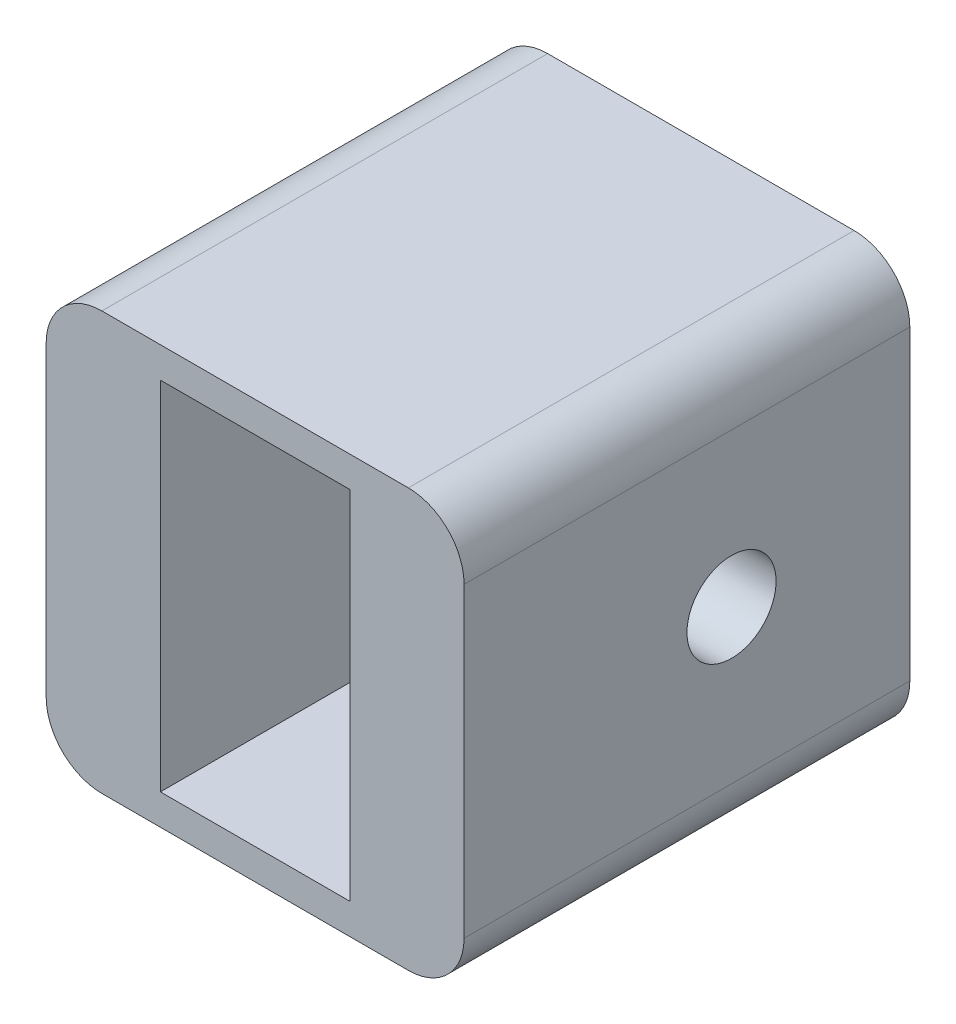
ISO-10303-21;
HEADER;
FILE_DESCRIPTION(('STEP AP214'),'2;1');
FILE_NAME('part.step','',(''),(''),'','','');
FILE_SCHEMA(('AUTOMOTIVE_DESIGN { 1 0 10303 214 1 1 1 1 }'));
ENDSEC;
DATA;
#1=APPLICATION_CONTEXT('core data for automotive mechanical design processes');
#2=APPLICATION_PROTOCOL_DEFINITION('international standard','automotive_design',2000,#1);
#3=PRODUCT_CONTEXT('',#1,'mechanical');
#4=PRODUCT('Part','Part','',(#3));
#5=PRODUCT_RELATED_PRODUCT_CATEGORY('part','',(#4));
#6=PRODUCT_DEFINITION_FORMATION('','',#4);
#7=PRODUCT_DEFINITION_CONTEXT('part definition',#1,'design');
#8=PRODUCT_DEFINITION('design','',#6,#7);
#9=PRODUCT_DEFINITION_SHAPE('','',#8);
#10=(LENGTH_UNIT() NAMED_UNIT(*) SI_UNIT(.MILLI.,.METRE.));
#11=(NAMED_UNIT(*) PLANE_ANGLE_UNIT() SI_UNIT($,.RADIAN.));
#12=(NAMED_UNIT(*) SI_UNIT($,.STERADIAN.) SOLID_ANGLE_UNIT());
#13=UNCERTAINTY_MEASURE_WITH_UNIT(LENGTH_MEASURE(1.E-05),#10,'distance_accuracy_value','');
#14=(GEOMETRIC_REPRESENTATION_CONTEXT(3) GLOBAL_UNCERTAINTY_ASSIGNED_CONTEXT((#13)) GLOBAL_UNIT_ASSIGNED_CONTEXT((#10,
#11,#12)) REPRESENTATION_CONTEXT('',''));
#15=CARTESIAN_POINT('',(0.,0.,0.));
#16=DIRECTION('',(0.,0.,1.));
#17=DIRECTION('',(1.,0.,0.));
#18=AXIS2_PLACEMENT_3D('',#15,#16,#17);
#19=CARTESIAN_POINT('',(-37.5,0.,32.));
#20=DIRECTION('',(1.,0.,0.));
#21=DIRECTION('',(0.,1.,0.));
#22=AXIS2_PLACEMENT_3D('',#19,#20,#21);
#23=CYLINDRICAL_SURFACE('',#22,8.);
#24=CARTESIAN_POINT('',(-17.,0.,32.));
#25=DIRECTION('',(-1.,0.,0.));
#26=DIRECTION('',(0.,-1.,0.));
#27=AXIS2_PLACEMENT_3D('',#24,#25,#26);
#28=CIRCLE('',#27,8.);
#29=CARTESIAN_POINT('',(-17.,-8.,32.));
#30=VERTEX_POINT('',#29);
#31=EDGE_CURVE('E28',#30,#30,#28,.F.);
#32=ORIENTED_EDGE('',*,*,#31,.T.);
#33=EDGE_LOOP('',(#32));
#34=FACE_BOUND('',#33,.T.);
#35=CARTESIAN_POINT('',(-37.5,0.,32.));
#36=DIRECTION('',(1.,0.,0.));
#37=DIRECTION('',(0.,1.,0.));
#38=AXIS2_PLACEMENT_3D('',#35,#36,#37);
#39=CIRCLE('',#38,8.);
#40=CARTESIAN_POINT('',(-37.5,8.00000000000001,32.));
#41=VERTEX_POINT('',#40);
#42=EDGE_CURVE('E156',#41,#41,#39,.T.);
#43=ORIENTED_EDGE('',*,*,#42,.F.);
#44=EDGE_LOOP('',(#43));
#45=FACE_BOUND('',#44,.T.);
#46=ADVANCED_FACE('F24',(#34,#45),#23,.F.);
#47=CARTESIAN_POINT('',(-27.5,27.5,80.));
#48=DIRECTION('',(0.,0.,-1.));
#49=DIRECTION('',(-1.,0.,0.));
#50=AXIS2_PLACEMENT_3D('',#47,#48,#49);
#51=CYLINDRICAL_SURFACE('',#50,10.);
#52=CARTESIAN_POINT('',(-27.5,27.5,0.));
#53=DIRECTION('',(0.,0.,1.));
#54=DIRECTION('',(-1.,0.,0.));
#55=AXIS2_PLACEMENT_3D('',#52,#53,#54);
#56=CIRCLE('',#55,10.);
#57=CARTESIAN_POINT('',(-27.4999999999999,37.5,0.));
#58=VERTEX_POINT('',#57);
#59=CARTESIAN_POINT('',(-37.5,27.4999999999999,0.));
#60=VERTEX_POINT('',#59);
#61=EDGE_CURVE('E159',#58,#60,#56,.T.);
#62=ORIENTED_EDGE('',*,*,#61,.T.);
#63=DIRECTION('',(0.,0.,-1.));
#64=VECTOR('',#63,1.);
#65=CARTESIAN_POINT('',(-37.5,27.4999999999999,80.));
#66=LINE('',#65,#64);
#67=CARTESIAN_POINT('',(-37.5,27.4999999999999,80.));
#68=VERTEX_POINT('',#67);
#69=EDGE_CURVE('E11',#68,#60,#66,.T.);
#70=ORIENTED_EDGE('',*,*,#69,.F.);
#71=CARTESIAN_POINT('',(-27.5,27.5,80.));
#72=DIRECTION('',(0.,0.,1.));
#73=DIRECTION('',(-1.,0.,0.));
#74=AXIS2_PLACEMENT_3D('',#71,#72,#73);
#75=CIRCLE('',#74,10.);
#76=CARTESIAN_POINT('',(-27.4999999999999,37.5,80.));
#77=VERTEX_POINT('',#76);
#78=EDGE_CURVE('E176',#77,#68,#75,.T.);
#79=ORIENTED_EDGE('',*,*,#78,.F.);
#80=DIRECTION('',(0.,0.,-1.));
#81=VECTOR('',#80,1.);
#82=CARTESIAN_POINT('',(-27.4999999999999,37.5,80.));
#83=LINE('',#82,#81);
#84=EDGE_CURVE('E193',#77,#58,#83,.T.);
#85=ORIENTED_EDGE('',*,*,#84,.T.);
#86=EDGE_LOOP('',(#62,#70,#79,#85));
#87=FACE_BOUND('',#86,.T.);
#88=ADVANCED_FACE('F26',(#87),#51,.T.);
#89=CARTESIAN_POINT('',(-37.5,27.4999999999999,80.));
#90=DIRECTION('',(1.,0.,0.));
#91=DIRECTION('',(0.,0.,-1.));
#92=AXIS2_PLACEMENT_3D('',#89,#90,#91);
#93=PLANE('',#92);
#94=ORIENTED_EDGE('',*,*,#42,.T.);
#95=EDGE_LOOP('',(#94));
#96=FACE_BOUND('',#95,.T.);
#97=DIRECTION('',(0.,-1.,0.));
#98=VECTOR('',#97,1.);
#99=CARTESIAN_POINT('',(-37.5,27.4999999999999,0.));
#100=LINE('',#99,#98);
#101=CARTESIAN_POINT('',(-37.5,-27.4999999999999,0.));
#102=VERTEX_POINT('',#101);
#103=EDGE_CURVE('E162',#60,#102,#100,.T.);
#104=ORIENTED_EDGE('',*,*,#103,.T.);
#105=DIRECTION('',(0.,0.,-1.));
#106=VECTOR('',#105,1.);
#107=CARTESIAN_POINT('',(-37.5,-27.4999999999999,80.));
#108=LINE('',#107,#106);
#109=CARTESIAN_POINT('',(-37.5,-27.4999999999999,80.));
#110=VERTEX_POINT('',#109);
#111=EDGE_CURVE('E33',#110,#102,#108,.T.);
#112=ORIENTED_EDGE('',*,*,#111,.F.);
#113=DIRECTION('',(0.,-1.,0.));
#114=VECTOR('',#113,1.);
#115=CARTESIAN_POINT('',(-37.5,27.4999999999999,80.));
#116=LINE('',#115,#114);
#117=EDGE_CURVE('E179',#68,#110,#116,.T.);
#118=ORIENTED_EDGE('',*,*,#117,.F.);
#119=ORIENTED_EDGE('',*,*,#69,.T.);
#120=EDGE_LOOP('',(#104,#112,#118,#119));
#121=FACE_BOUND('',#120,.T.);
#122=ADVANCED_FACE('F237',(#96,#121),#93,.F.);
#123=CARTESIAN_POINT('',(-27.5,-27.5,80.));
#124=DIRECTION('',(0.,0.,-1.));
#125=DIRECTION('',(-1.,0.,0.));
#126=AXIS2_PLACEMENT_3D('',#123,#124,#125);
#127=CYLINDRICAL_SURFACE('',#126,10.);
#128=CARTESIAN_POINT('',(-27.5,-27.5,0.));
#129=DIRECTION('',(0.,0.,1.));
#130=DIRECTION('',(-1.,0.,0.));
#131=AXIS2_PLACEMENT_3D('',#128,#129,#130);
#132=CIRCLE('',#131,10.);
#133=CARTESIAN_POINT('',(-27.4999999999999,-37.5,0.));
#134=VERTEX_POINT('',#133);
#135=EDGE_CURVE('E164',#102,#134,#132,.T.);
#136=ORIENTED_EDGE('',*,*,#135,.T.);
#137=DIRECTION('',(0.,0.,-1.));
#138=VECTOR('',#137,1.);
#139=CARTESIAN_POINT('',(-27.4999999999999,-37.5,80.));
#140=LINE('',#139,#138);
#141=CARTESIAN_POINT('',(-27.4999999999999,-37.5,80.));
#142=VERTEX_POINT('',#141);
#143=EDGE_CURVE('E208',#142,#134,#140,.T.);
#144=ORIENTED_EDGE('',*,*,#143,.F.);
#145=CARTESIAN_POINT('',(-27.5,-27.5,80.));
#146=DIRECTION('',(0.,0.,1.));
#147=DIRECTION('',(-1.,0.,0.));
#148=AXIS2_PLACEMENT_3D('',#145,#146,#147);
#149=CIRCLE('',#148,10.);
#150=EDGE_CURVE('E181',#110,#142,#149,.T.);
#151=ORIENTED_EDGE('',*,*,#150,.F.);
#152=ORIENTED_EDGE('',*,*,#111,.T.);
#153=EDGE_LOOP('',(#136,#144,#151,#152));
#154=FACE_BOUND('',#153,.T.);
#155=ADVANCED_FACE('F264',(#154),#127,.T.);
#156=CARTESIAN_POINT('',(-27.4999999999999,-37.5,80.));
#157=DIRECTION('',(0.,1.,0.));
#158=DIRECTION('',(0.,0.,1.));
#159=AXIS2_PLACEMENT_3D('',#156,#157,#158);
#160=PLANE('',#159);
#161=DIRECTION('',(1.,0.,0.));
#162=VECTOR('',#161,1.);
#163=CARTESIAN_POINT('',(-27.4999999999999,-37.5,0.));
#164=LINE('',#163,#162);
#165=CARTESIAN_POINT('',(27.4999999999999,-37.5,0.));
#166=VERTEX_POINT('',#165);
#167=EDGE_CURVE('E166',#134,#166,#164,.T.);
#168=ORIENTED_EDGE('',*,*,#167,.T.);
#169=DIRECTION('',(0.,0.,-1.));
#170=VECTOR('',#169,1.);
#171=CARTESIAN_POINT('',(27.4999999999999,-37.5,80.));
#172=LINE('',#171,#170);
#173=CARTESIAN_POINT('',(27.4999999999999,-37.5,80.));
#174=VERTEX_POINT('',#173);
#175=EDGE_CURVE('E205',#174,#166,#172,.T.);
#176=ORIENTED_EDGE('',*,*,#175,.F.);
#177=DIRECTION('',(1.,0.,0.));
#178=VECTOR('',#177,1.);
#179=CARTESIAN_POINT('',(-27.4999999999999,-37.5,80.));
#180=LINE('',#179,#178);
#181=EDGE_CURVE('E183',#142,#174,#180,.T.);
#182=ORIENTED_EDGE('',*,*,#181,.F.);
#183=ORIENTED_EDGE('',*,*,#143,.T.);
#184=EDGE_LOOP('',(#168,#176,#182,#183));
#185=FACE_BOUND('',#184,.T.);
#186=ADVANCED_FACE('F260',(#185),#160,.F.);
#187=CARTESIAN_POINT('',(27.5,-27.5,80.));
#188=DIRECTION('',(0.,0.,-1.));
#189=DIRECTION('',(-1.,0.,0.));
#190=AXIS2_PLACEMENT_3D('',#187,#188,#189);
#191=CYLINDRICAL_SURFACE('',#190,10.);
#192=CARTESIAN_POINT('',(27.5,-27.5,0.));
#193=DIRECTION('',(0.,0.,1.));
#194=DIRECTION('',(-1.,0.,0.));
#195=AXIS2_PLACEMENT_3D('',#192,#193,#194);
#196=CIRCLE('',#195,10.);
#197=CARTESIAN_POINT('',(37.5,-27.4999999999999,0.));
#198=VERTEX_POINT('',#197);
#199=EDGE_CURVE('E168',#166,#198,#196,.T.);
#200=ORIENTED_EDGE('',*,*,#199,.T.);
#201=DIRECTION('',(0.,0.,-1.));
#202=VECTOR('',#201,1.);
#203=CARTESIAN_POINT('',(37.5,-27.4999999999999,80.));
#204=LINE('',#203,#202);
#205=CARTESIAN_POINT('',(37.5,-27.4999999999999,80.));
#206=VERTEX_POINT('',#205);
#207=EDGE_CURVE('E202',#206,#198,#204,.T.);
#208=ORIENTED_EDGE('',*,*,#207,.F.);
#209=CARTESIAN_POINT('',(27.5,-27.5,80.));
#210=DIRECTION('',(0.,0.,1.));
#211=DIRECTION('',(-1.,0.,0.));
#212=AXIS2_PLACEMENT_3D('',#209,#210,#211);
#213=CIRCLE('',#212,10.);
#214=EDGE_CURVE('E185',#174,#206,#213,.T.);
#215=ORIENTED_EDGE('',*,*,#214,.F.);
#216=ORIENTED_EDGE('',*,*,#175,.T.);
#217=EDGE_LOOP('',(#200,#208,#215,#216));
#218=FACE_BOUND('',#217,.T.);
#219=ADVANCED_FACE('F256',(#218),#191,.T.);
#220=CARTESIAN_POINT('',(37.5,27.4999999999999,80.));
#221=DIRECTION('',(-1.,0.,0.));
#222=DIRECTION('',(0.,-1.,0.));
#223=AXIS2_PLACEMENT_3D('',#220,#221,#222);
#224=PLANE('',#223);
#225=CARTESIAN_POINT('',(37.5,0.,32.));
#226=DIRECTION('',(1.,0.,0.));
#227=DIRECTION('',(0.,1.,0.));
#228=AXIS2_PLACEMENT_3D('',#225,#226,#227);
#229=CIRCLE('',#228,8.);
#230=CARTESIAN_POINT('',(37.5,7.99999999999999,32.));
#231=VERTEX_POINT('',#230);
#232=EDGE_CURVE('E153',#231,#231,#229,.T.);
#233=ORIENTED_EDGE('',*,*,#232,.F.);
#234=EDGE_LOOP('',(#233));
#235=FACE_BOUND('',#234,.T.);
#236=DIRECTION('',(0.,1.,0.));
#237=VECTOR('',#236,1.);
#238=CARTESIAN_POINT('',(37.5,27.4999999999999,0.));
#239=LINE('',#238,#237);
#240=CARTESIAN_POINT('',(37.5,27.4999999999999,0.));
#241=VERTEX_POINT('',#240);
#242=EDGE_CURVE('E170',#198,#241,#239,.T.);
#243=ORIENTED_EDGE('',*,*,#242,.T.);
#244=DIRECTION('',(0.,0.,-1.));
#245=VECTOR('',#244,1.);
#246=CARTESIAN_POINT('',(37.5,27.4999999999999,80.));
#247=LINE('',#246,#245);
#248=CARTESIAN_POINT('',(37.5,27.4999999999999,80.));
#249=VERTEX_POINT('',#248);
#250=EDGE_CURVE('E199',#249,#241,#247,.T.);
#251=ORIENTED_EDGE('',*,*,#250,.F.);
#252=DIRECTION('',(0.,1.,0.));
#253=VECTOR('',#252,1.);
#254=CARTESIAN_POINT('',(37.5,27.4999999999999,80.));
#255=LINE('',#254,#253);
#256=EDGE_CURVE('E187',#206,#249,#255,.T.);
#257=ORIENTED_EDGE('',*,*,#256,.F.);
#258=ORIENTED_EDGE('',*,*,#207,.T.);
#259=EDGE_LOOP('',(#243,#251,#257,#258));
#260=FACE_BOUND('',#259,.T.);
#261=ADVANCED_FACE('F252',(#235,#260),#224,.F.);
#262=CARTESIAN_POINT('',(27.5,27.5,80.));
#263=DIRECTION('',(0.,0.,-1.));
#264=DIRECTION('',(-1.,0.,0.));
#265=AXIS2_PLACEMENT_3D('',#262,#263,#264);
#266=CYLINDRICAL_SURFACE('',#265,10.);
#267=CARTESIAN_POINT('',(27.5,27.5,0.));
#268=DIRECTION('',(0.,0.,1.));
#269=DIRECTION('',(-1.,0.,0.));
#270=AXIS2_PLACEMENT_3D('',#267,#268,#269);
#271=CIRCLE('',#270,10.);
#272=CARTESIAN_POINT('',(27.4999999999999,37.5,0.));
#273=VERTEX_POINT('',#272);
#274=EDGE_CURVE('E172',#241,#273,#271,.T.);
#275=ORIENTED_EDGE('',*,*,#274,.T.);
#276=DIRECTION('',(0.,0.,-1.));
#277=VECTOR('',#276,1.);
#278=CARTESIAN_POINT('',(27.4999999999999,37.5,80.));
#279=LINE('',#278,#277);
#280=CARTESIAN_POINT('',(27.4999999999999,37.5,80.));
#281=VERTEX_POINT('',#280);
#282=EDGE_CURVE('E196',#281,#273,#279,.T.);
#283=ORIENTED_EDGE('',*,*,#282,.F.);
#284=CARTESIAN_POINT('',(27.5,27.5,80.));
#285=DIRECTION('',(0.,0.,1.));
#286=DIRECTION('',(-1.,0.,0.));
#287=AXIS2_PLACEMENT_3D('',#284,#285,#286);
#288=CIRCLE('',#287,10.);
#289=EDGE_CURVE('E189',#249,#281,#288,.T.);
#290=ORIENTED_EDGE('',*,*,#289,.F.);
#291=ORIENTED_EDGE('',*,*,#250,.T.);
#292=EDGE_LOOP('',(#275,#283,#290,#291));
#293=FACE_BOUND('',#292,.T.);
#294=ADVANCED_FACE('F248',(#293),#266,.T.);
#295=CARTESIAN_POINT('',(-27.4999999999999,37.5,80.));
#296=DIRECTION('',(0.,-1.,0.));
#297=DIRECTION('',(0.,0.,-1.));
#298=AXIS2_PLACEMENT_3D('',#295,#296,#297);
#299=PLANE('',#298);
#300=DIRECTION('',(-1.,0.,0.));
#301=VECTOR('',#300,1.);
#302=CARTESIAN_POINT('',(-27.4999999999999,37.5,0.));
#303=LINE('',#302,#301);
#304=EDGE_CURVE('E174',#273,#58,#303,.T.);
#305=ORIENTED_EDGE('',*,*,#304,.T.);
#306=ORIENTED_EDGE('',*,*,#84,.F.);
#307=DIRECTION('',(-1.,0.,0.));
#308=VECTOR('',#307,1.);
#309=CARTESIAN_POINT('',(-27.4999999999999,37.5,80.));
#310=LINE('',#309,#308);
#311=EDGE_CURVE('E191',#281,#77,#310,.T.);
#312=ORIENTED_EDGE('',*,*,#311,.F.);
#313=ORIENTED_EDGE('',*,*,#282,.T.);
#314=EDGE_LOOP('',(#305,#306,#312,#313));
#315=FACE_BOUND('',#314,.T.);
#316=ADVANCED_FACE('F245',(#315),#299,.F.);
#317=CARTESIAN_POINT('',(-27.5,27.5,80.));
#318=DIRECTION('',(0.,0.,-1.));
#319=DIRECTION('',(-1.,0.,0.));
#320=AXIS2_PLACEMENT_3D('',#317,#318,#319);
#321=PLANE('',#320);
#322=DIRECTION('',(1.,0.,0.));
#323=VECTOR('',#322,1.);
#324=CARTESIAN_POINT('',(-17.,-32.,80.));
#325=LINE('',#324,#323);
#326=CARTESIAN_POINT('',(-17.,-32.,80.));
#327=VERTEX_POINT('',#326);
#328=CARTESIAN_POINT('',(17.,-32.,80.));
#329=VERTEX_POINT('',#328);
#330=EDGE_CURVE('E127',#327,#329,#325,.T.);
#331=ORIENTED_EDGE('',*,*,#330,.F.);
#332=DIRECTION('',(0.,-1.,0.));
#333=VECTOR('',#332,1.);
#334=CARTESIAN_POINT('',(-17.,32.,80.));
#335=LINE('',#334,#333);
#336=CARTESIAN_POINT('',(-17.,32.,80.));
#337=VERTEX_POINT('',#336);
#338=EDGE_CURVE('E41',#337,#327,#335,.T.);
#339=ORIENTED_EDGE('',*,*,#338,.F.);
#340=DIRECTION('',(-1.,0.,0.));
#341=VECTOR('',#340,1.);
#342=CARTESIAN_POINT('',(-17.,32.,80.));
#343=LINE('',#342,#341);
#344=CARTESIAN_POINT('',(17.,32.,80.));
#345=VERTEX_POINT('',#344);
#346=EDGE_CURVE('E134',#345,#337,#343,.T.);
#347=ORIENTED_EDGE('',*,*,#346,.F.);
#348=DIRECTION('',(0.,1.,0.));
#349=VECTOR('',#348,1.);
#350=CARTESIAN_POINT('',(17.,32.,80.));
#351=LINE('',#350,#349);
#352=EDGE_CURVE('E118',#329,#345,#351,.T.);
#353=ORIENTED_EDGE('',*,*,#352,.F.);
#354=EDGE_LOOP('',(#331,#339,#347,#353));
#355=FACE_BOUND('',#354,.T.);
#356=ORIENTED_EDGE('',*,*,#78,.T.);
#357=ORIENTED_EDGE('',*,*,#117,.T.);
#358=ORIENTED_EDGE('',*,*,#150,.T.);
#359=ORIENTED_EDGE('',*,*,#181,.T.);
#360=ORIENTED_EDGE('',*,*,#214,.T.);
#361=ORIENTED_EDGE('',*,*,#256,.T.);
#362=ORIENTED_EDGE('',*,*,#289,.T.);
#363=ORIENTED_EDGE('',*,*,#311,.T.);
#364=EDGE_LOOP('',(#356,#357,#358,#359,#360,#361,#362,#363));
#365=FACE_BOUND('',#364,.T.);
#366=ADVANCED_FACE('F131',(#355,#365),#321,.F.);
#367=CARTESIAN_POINT('',(-27.5,27.5,0.));
#368=DIRECTION('',(0.,0.,-1.));
#369=DIRECTION('',(-1.,0.,0.));
#370=AXIS2_PLACEMENT_3D('',#367,#368,#369);
#371=PLANE('',#370);
#372=DIRECTION('',(0.,-1.,0.));
#373=VECTOR('',#372,1.);
#374=CARTESIAN_POINT('',(-17.,32.,0.));
#375=LINE('',#374,#373);
#376=CARTESIAN_POINT('',(-17.,32.,0.));
#377=VERTEX_POINT('',#376);
#378=CARTESIAN_POINT('',(-17.,-32.,0.));
#379=VERTEX_POINT('',#378);
#380=EDGE_CURVE('E136',#377,#379,#375,.T.);
#381=ORIENTED_EDGE('',*,*,#380,.T.);
#382=DIRECTION('',(1.,0.,0.));
#383=VECTOR('',#382,1.);
#384=CARTESIAN_POINT('',(-17.,-32.,0.));
#385=LINE('',#384,#383);
#386=CARTESIAN_POINT('',(17.,-32.,0.));
#387=VERTEX_POINT('',#386);
#388=EDGE_CURVE('E142',#379,#387,#385,.T.);
#389=ORIENTED_EDGE('',*,*,#388,.T.);
#390=DIRECTION('',(0.,1.,0.));
#391=VECTOR('',#390,1.);
#392=CARTESIAN_POINT('',(17.,32.,0.));
#393=LINE('',#392,#391);
#394=CARTESIAN_POINT('',(17.,32.,0.));
#395=VERTEX_POINT('',#394);
#396=EDGE_CURVE('E49',#387,#395,#393,.T.);
#397=ORIENTED_EDGE('',*,*,#396,.T.);
#398=DIRECTION('',(-1.,0.,0.));
#399=VECTOR('',#398,1.);
#400=CARTESIAN_POINT('',(-17.,32.,0.));
#401=LINE('',#400,#399);
#402=EDGE_CURVE('E145',#395,#377,#401,.T.);
#403=ORIENTED_EDGE('',*,*,#402,.T.);
#404=EDGE_LOOP('',(#381,#389,#397,#403));
#405=FACE_BOUND('',#404,.T.);
#406=ORIENTED_EDGE('',*,*,#61,.F.);
#407=ORIENTED_EDGE('',*,*,#304,.F.);
#408=ORIENTED_EDGE('',*,*,#274,.F.);
#409=ORIENTED_EDGE('',*,*,#242,.F.);
#410=ORIENTED_EDGE('',*,*,#199,.F.);
#411=ORIENTED_EDGE('',*,*,#167,.F.);
#412=ORIENTED_EDGE('',*,*,#135,.F.);
#413=ORIENTED_EDGE('',*,*,#103,.F.);
#414=EDGE_LOOP('',(#406,#407,#408,#409,#410,#411,#412,#413));
#415=FACE_BOUND('',#414,.T.);
#416=ADVANCED_FACE('F230',(#405,#415),#371,.T.);
#417=CARTESIAN_POINT('',(17.,0.,32.));
#418=DIRECTION('',(1.,0.,0.));
#419=DIRECTION('',(0.,1.,0.));
#420=AXIS2_PLACEMENT_3D('',#417,#418,#419);
#421=CIRCLE('',#420,8.);
#422=CARTESIAN_POINT('',(17.,8.,32.));
#423=VERTEX_POINT('',#422);
#424=EDGE_CURVE('E150',#423,#423,#421,.F.);
#425=ORIENTED_EDGE('',*,*,#424,.T.);
#426=EDGE_LOOP('',(#425));
#427=FACE_BOUND('',#426,.T.);
#428=ORIENTED_EDGE('',*,*,#232,.T.);
#429=EDGE_LOOP('',(#428));
#430=FACE_BOUND('',#429,.T.);
#431=ADVANCED_FACE('F222',(#427,#430),#23,.F.);
#432=CARTESIAN_POINT('',(-17.,32.,0.));
#433=DIRECTION('',(-1.,0.,0.));
#434=DIRECTION('',(0.,-1.,0.));
#435=AXIS2_PLACEMENT_3D('',#432,#433,#434);
#436=PLANE('',#435);
#437=ORIENTED_EDGE('',*,*,#338,.T.);
#438=DIRECTION('',(0.,0.,1.));
#439=VECTOR('',#438,1.);
#440=CARTESIAN_POINT('',(-17.,-32.,0.));
#441=LINE('',#440,#439);
#442=EDGE_CURVE('E124',#379,#327,#441,.T.);
#443=ORIENTED_EDGE('',*,*,#442,.F.);
#444=ORIENTED_EDGE('',*,*,#380,.F.);
#445=DIRECTION('',(0.,0.,1.));
#446=VECTOR('',#445,1.);
#447=CARTESIAN_POINT('',(-17.,32.,0.));
#448=LINE('',#447,#446);
#449=EDGE_CURVE('E148',#377,#337,#448,.T.);
#450=ORIENTED_EDGE('',*,*,#449,.T.);
#451=EDGE_LOOP('',(#437,#443,#444,#450));
#452=FACE_BOUND('',#451,.T.);
#453=ORIENTED_EDGE('',*,*,#31,.F.);
#454=EDGE_LOOP('',(#453));
#455=FACE_BOUND('',#454,.T.);
#456=ADVANCED_FACE('F220',(#452,#455),#436,.F.);
#457=CARTESIAN_POINT('',(17.,32.,0.));
#458=DIRECTION('',(1.,0.,0.));
#459=DIRECTION('',(0.,1.,0.));
#460=AXIS2_PLACEMENT_3D('',#457,#458,#459);
#461=PLANE('',#460);
#462=ORIENTED_EDGE('',*,*,#352,.T.);
#463=DIRECTION('',(0.,0.,1.));
#464=VECTOR('',#463,1.);
#465=CARTESIAN_POINT('',(17.,32.,0.));
#466=LINE('',#465,#464);
#467=EDGE_CURVE('E123',#395,#345,#466,.T.);
#468=ORIENTED_EDGE('',*,*,#467,.F.);
#469=ORIENTED_EDGE('',*,*,#396,.F.);
#470=DIRECTION('',(0.,0.,1.));
#471=VECTOR('',#470,1.);
#472=CARTESIAN_POINT('',(17.,-32.,0.));
#473=LINE('',#472,#471);
#474=EDGE_CURVE('E113',#387,#329,#473,.T.);
#475=ORIENTED_EDGE('',*,*,#474,.T.);
#476=EDGE_LOOP('',(#462,#468,#469,#475));
#477=FACE_BOUND('',#476,.T.);
#478=ORIENTED_EDGE('',*,*,#424,.F.);
#479=EDGE_LOOP('',(#478));
#480=FACE_BOUND('',#479,.T.);
#481=ADVANCED_FACE('F115',(#477,#480),#461,.F.);
#482=CARTESIAN_POINT('',(-17.,32.,0.));
#483=DIRECTION('',(0.,1.,0.));
#484=DIRECTION('',(0.,0.,1.));
#485=AXIS2_PLACEMENT_3D('',#482,#483,#484);
#486=PLANE('',#485);
#487=ORIENTED_EDGE('',*,*,#346,.T.);
#488=ORIENTED_EDGE('',*,*,#449,.F.);
#489=ORIENTED_EDGE('',*,*,#402,.F.);
#490=ORIENTED_EDGE('',*,*,#467,.T.);
#491=EDGE_LOOP('',(#487,#488,#489,#490));
#492=FACE_BOUND('',#491,.T.);
#493=ADVANCED_FACE('F228',(#492),#486,.F.);
#494=CARTESIAN_POINT('',(-17.,-32.,0.));
#495=DIRECTION('',(0.,-1.,0.));
#496=DIRECTION('',(0.,0.,-1.));
#497=AXIS2_PLACEMENT_3D('',#494,#495,#496);
#498=PLANE('',#497);
#499=ORIENTED_EDGE('',*,*,#330,.T.);
#500=ORIENTED_EDGE('',*,*,#474,.F.);
#501=ORIENTED_EDGE('',*,*,#388,.F.);
#502=ORIENTED_EDGE('',*,*,#442,.T.);
#503=EDGE_LOOP('',(#499,#500,#501,#502));
#504=FACE_BOUND('',#503,.T.);
#505=ADVANCED_FACE('F128',(#504),#498,.F.);
#506=CLOSED_SHELL('',(#46,#88,#122,#155,#186,#219,#261,#294,#316,#366,#416,#431,#456,#481,#493,#505));
#507=MANIFOLD_SOLID_BREP('B2',#506);
#508=ADVANCED_BREP_SHAPE_REPRESENTATION('',(#18,#507),#14);
#509=SHAPE_DEFINITION_REPRESENTATION(#9,#508);
ENDSEC;
END-ISO-10303-21;
